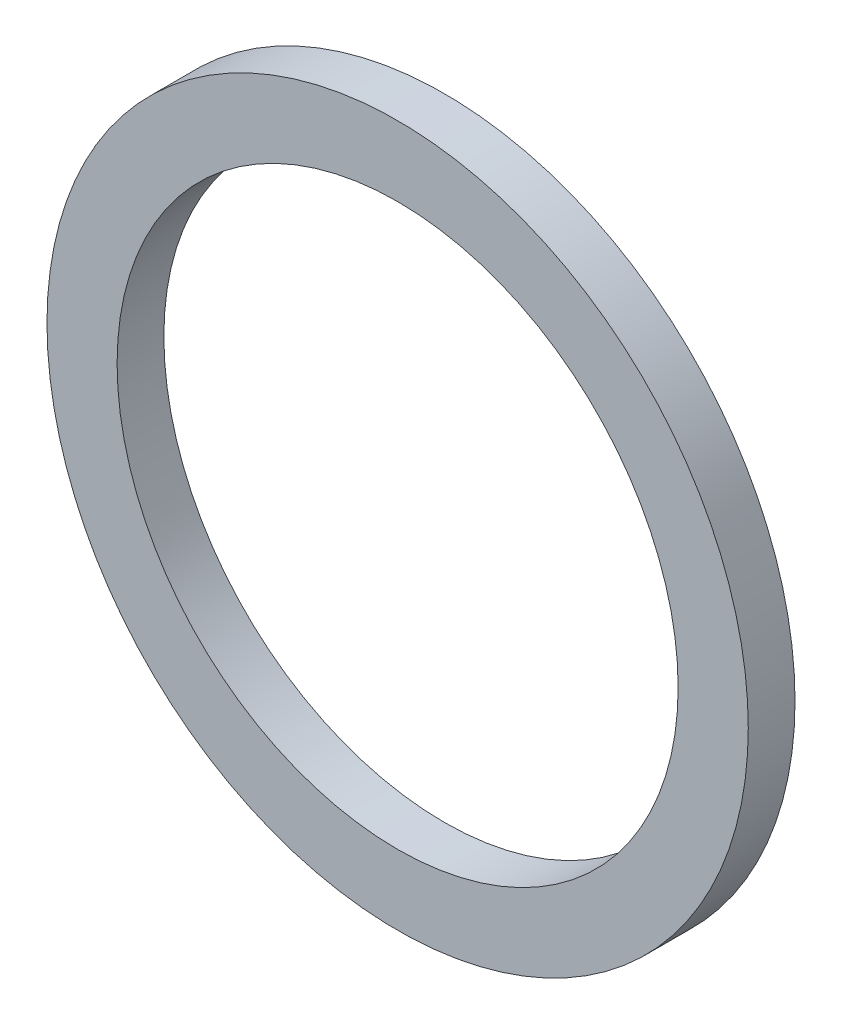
ISO-10303-21;
HEADER;
FILE_DESCRIPTION(('STEP AP214'),'2;1');
FILE_NAME('part.step','',(''),(''),'','','');
FILE_SCHEMA(('AUTOMOTIVE_DESIGN { 1 0 10303 214 1 1 1 1 }'));
ENDSEC;
DATA;
#1=APPLICATION_CONTEXT('core data for automotive mechanical design processes');
#2=APPLICATION_PROTOCOL_DEFINITION('international standard','automotive_design',2000,#1);
#3=PRODUCT_CONTEXT('',#1,'mechanical');
#4=PRODUCT('Part','Part','',(#3));
#5=PRODUCT_RELATED_PRODUCT_CATEGORY('part','',(#4));
#6=PRODUCT_DEFINITION_FORMATION('','',#4);
#7=PRODUCT_DEFINITION_CONTEXT('part definition',#1,'design');
#8=PRODUCT_DEFINITION('design','',#6,#7);
#9=PRODUCT_DEFINITION_SHAPE('','',#8);
#10=(LENGTH_UNIT() NAMED_UNIT(*) SI_UNIT(.MILLI.,.METRE.));
#11=(NAMED_UNIT(*) PLANE_ANGLE_UNIT() SI_UNIT($,.RADIAN.));
#12=(NAMED_UNIT(*) SI_UNIT($,.STERADIAN.) SOLID_ANGLE_UNIT());
#13=UNCERTAINTY_MEASURE_WITH_UNIT(LENGTH_MEASURE(1.E-05),#10,'distance_accuracy_value','');
#14=(GEOMETRIC_REPRESENTATION_CONTEXT(3) GLOBAL_UNCERTAINTY_ASSIGNED_CONTEXT((#13)) GLOBAL_UNIT_ASSIGNED_CONTEXT((#10,
#11,#12)) REPRESENTATION_CONTEXT('',''));
#15=CARTESIAN_POINT('',(0.,0.,0.));
#16=DIRECTION('',(0.,0.,1.));
#17=DIRECTION('',(1.,0.,0.));
#18=AXIS2_PLACEMENT_3D('',#15,#16,#17);
#19=CARTESIAN_POINT('',(0.,0.,2.));
#20=DIRECTION('',(0.,0.,1.));
#21=DIRECTION('',(1.,0.,0.));
#22=AXIS2_PLACEMENT_3D('',#19,#20,#21);
#23=PLANE('',#22);
#24=CARTESIAN_POINT('',(0.,0.,2.));
#25=DIRECTION('',(0.,0.,1.));
#26=DIRECTION('',(1.,0.,0.));
#27=AXIS2_PLACEMENT_3D('',#24,#25,#26);
#28=CIRCLE('',#27,7.5);
#29=CARTESIAN_POINT('',(7.5,0.,2.));
#30=VERTEX_POINT('',#29);
#31=EDGE_CURVE('E10',#30,#30,#28,.T.);
#32=ORIENTED_EDGE('',*,*,#31,.T.);
#33=EDGE_LOOP('',(#32));
#34=FACE_BOUND('',#33,.T.);
#35=CARTESIAN_POINT('',(0.,0.,2.));
#36=DIRECTION('',(0.,0.,1.));
#37=DIRECTION('',(1.,0.,0.));
#38=AXIS2_PLACEMENT_3D('',#35,#36,#37);
#39=CIRCLE('',#38,6.);
#40=CARTESIAN_POINT('',(6.,0.,2.));
#41=VERTEX_POINT('',#40);
#42=EDGE_CURVE('E40',#41,#41,#39,.T.);
#43=ORIENTED_EDGE('',*,*,#42,.F.);
#44=EDGE_LOOP('',(#43));
#45=FACE_BOUND('',#44,.T.);
#46=ADVANCED_FACE('F29',(#34,#45),#23,.T.);
#47=CARTESIAN_POINT('',(0.,0.,1.));
#48=DIRECTION('',(0.,0.,1.));
#49=DIRECTION('',(1.,0.,0.));
#50=AXIS2_PLACEMENT_3D('',#47,#48,#49);
#51=PLANE('',#50);
#52=CARTESIAN_POINT('',(0.,0.,1.));
#53=DIRECTION('',(0.,0.,1.));
#54=DIRECTION('',(1.,0.,0.));
#55=AXIS2_PLACEMENT_3D('',#52,#53,#54);
#56=CIRCLE('',#55,7.5);
#57=CARTESIAN_POINT('',(7.5,0.,1.));
#58=VERTEX_POINT('',#57);
#59=EDGE_CURVE('E33',#58,#58,#56,.T.);
#60=ORIENTED_EDGE('',*,*,#59,.F.);
#61=EDGE_LOOP('',(#60));
#62=FACE_BOUND('',#61,.T.);
#63=CARTESIAN_POINT('',(0.,0.,1.));
#64=DIRECTION('',(0.,0.,1.));
#65=DIRECTION('',(1.,0.,0.));
#66=AXIS2_PLACEMENT_3D('',#63,#64,#65);
#67=CIRCLE('',#66,6.);
#68=CARTESIAN_POINT('',(6.,0.,1.));
#69=VERTEX_POINT('',#68);
#70=EDGE_CURVE('E42',#69,#69,#67,.T.);
#71=ORIENTED_EDGE('',*,*,#70,.T.);
#72=EDGE_LOOP('',(#71));
#73=FACE_BOUND('',#72,.T.);
#74=ADVANCED_FACE('F52',(#62,#73),#51,.F.);
#75=CARTESIAN_POINT('',(0.,0.,2.));
#76=DIRECTION('',(0.,0.,-1.));
#77=DIRECTION('',(-1.,0.,0.));
#78=AXIS2_PLACEMENT_3D('',#75,#76,#77);
#79=CYLINDRICAL_SURFACE('',#78,7.5);
#80=ORIENTED_EDGE('',*,*,#31,.F.);
#81=EDGE_LOOP('',(#80));
#82=FACE_BOUND('',#81,.T.);
#83=ORIENTED_EDGE('',*,*,#59,.T.);
#84=EDGE_LOOP('',(#83));
#85=FACE_BOUND('',#84,.T.);
#86=ADVANCED_FACE('F31',(#82,#85),#79,.T.);
#87=CARTESIAN_POINT('',(0.,0.,2.));
#88=DIRECTION('',(0.,0.,-1.));
#89=DIRECTION('',(-1.,0.,0.));
#90=AXIS2_PLACEMENT_3D('',#87,#88,#89);
#91=CYLINDRICAL_SURFACE('',#90,6.);
#92=ORIENTED_EDGE('',*,*,#42,.T.);
#93=EDGE_LOOP('',(#92));
#94=FACE_BOUND('',#93,.T.);
#95=ORIENTED_EDGE('',*,*,#70,.F.);
#96=EDGE_LOOP('',(#95));
#97=FACE_BOUND('',#96,.T.);
#98=ADVANCED_FACE('F48',(#94,#97),#91,.F.);
#99=CLOSED_SHELL('',(#46,#74,#86,#98));
#100=MANIFOLD_SOLID_BREP('B2',#99);
#101=ADVANCED_BREP_SHAPE_REPRESENTATION('',(#18,#100),#14);
#102=SHAPE_DEFINITION_REPRESENTATION(#9,#101);
ENDSEC;
END-ISO-10303-21;
